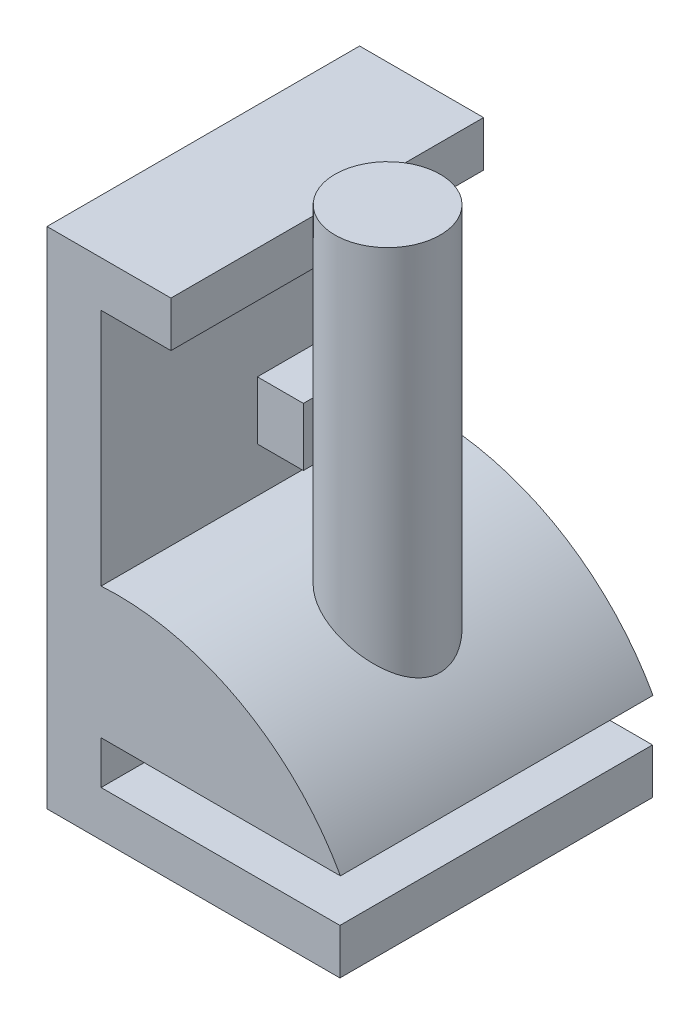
ISO-10303-21;
HEADER;
FILE_DESCRIPTION(('STEP AP214'),'2;1');
FILE_NAME('part.step','',(''),(''),'','','');
FILE_SCHEMA(('AUTOMOTIVE_DESIGN { 1 0 10303 214 1 1 1 1 }'));
ENDSEC;
DATA;
#1=APPLICATION_CONTEXT('core data for automotive mechanical design processes');
#2=APPLICATION_PROTOCOL_DEFINITION('international standard','automotive_design',2000,#1);
#3=PRODUCT_CONTEXT('',#1,'mechanical');
#4=PRODUCT('Part','Part','',(#3));
#5=PRODUCT_RELATED_PRODUCT_CATEGORY('part','',(#4));
#6=PRODUCT_DEFINITION_FORMATION('','',#4);
#7=PRODUCT_DEFINITION_CONTEXT('part definition',#1,'design');
#8=PRODUCT_DEFINITION('design','',#6,#7);
#9=PRODUCT_DEFINITION_SHAPE('','',#8);
#10=(LENGTH_UNIT() NAMED_UNIT(*) SI_UNIT(.MILLI.,.METRE.));
#11=(NAMED_UNIT(*) PLANE_ANGLE_UNIT() SI_UNIT($,.RADIAN.));
#12=(NAMED_UNIT(*) SI_UNIT($,.STERADIAN.) SOLID_ANGLE_UNIT());
#13=UNCERTAINTY_MEASURE_WITH_UNIT(LENGTH_MEASURE(1.E-05),#10,'distance_accuracy_value','');
#14=(GEOMETRIC_REPRESENTATION_CONTEXT(3) GLOBAL_UNCERTAINTY_ASSIGNED_CONTEXT((#13)) GLOBAL_UNIT_ASSIGNED_CONTEXT((#10,
#11,#12)) REPRESENTATION_CONTEXT('',''));
#15=CARTESIAN_POINT('',(0.,0.,0.));
#16=DIRECTION('',(0.,0.,1.));
#17=DIRECTION('',(1.,0.,0.));
#18=AXIS2_PLACEMENT_3D('',#15,#16,#17);
#19=CARTESIAN_POINT('',(152.004557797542,-86.5512105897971,47.5));
#20=DIRECTION('',(0.,1.,0.));
#21=DIRECTION('',(0.,0.,1.));
#22=AXIS2_PLACEMENT_3D('',#19,#20,#21);
#23=PLANE('',#22);
#24=DIRECTION('',(1.,0.,0.));
#25=VECTOR('',#24,1.);
#26=CARTESIAN_POINT('',(152.004557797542,-86.5512105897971,-47.5));
#27=LINE('',#26,#25);
#28=CARTESIAN_POINT('',(62.9855483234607,-86.5512105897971,-47.5));
#29=VERTEX_POINT('',#28);
#30=CARTESIAN_POINT('',(152.004557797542,-86.5512105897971,-47.5));
#31=VERTEX_POINT('',#30);
#32=EDGE_CURVE('E163',#29,#31,#27,.T.);
#33=ORIENTED_EDGE('',*,*,#32,.T.);
#34=DIRECTION('',(0.,0.,-1.));
#35=VECTOR('',#34,1.);
#36=CARTESIAN_POINT('',(152.004557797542,-86.5512105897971,47.5));
#37=LINE('',#36,#35);
#38=CARTESIAN_POINT('',(152.004557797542,-86.5512105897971,47.5));
#39=VERTEX_POINT('',#38);
#40=EDGE_CURVE('E11',#39,#31,#37,.T.);
#41=ORIENTED_EDGE('',*,*,#40,.F.);
#42=DIRECTION('',(1.,0.,0.));
#43=VECTOR('',#42,1.);
#44=CARTESIAN_POINT('',(152.004557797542,-86.5512105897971,47.5));
#45=LINE('',#44,#43);
#46=CARTESIAN_POINT('',(62.9855483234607,-86.5512105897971,47.5));
#47=VERTEX_POINT('',#46);
#48=EDGE_CURVE('E196',#47,#39,#45,.T.);
#49=ORIENTED_EDGE('',*,*,#48,.F.);
#50=DIRECTION('',(0.,0.,-1.));
#51=VECTOR('',#50,1.);
#52=CARTESIAN_POINT('',(62.9855483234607,-86.5512105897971,47.5));
#53=LINE('',#52,#51);
#54=EDGE_CURVE('E159',#47,#29,#53,.T.);
#55=ORIENTED_EDGE('',*,*,#54,.T.);
#56=EDGE_LOOP('',(#33,#41,#49,#55));
#57=FACE_BOUND('',#56,.T.);
#58=ADVANCED_FACE('F33',(#57),#23,.F.);
#59=CARTESIAN_POINT('',(152.004557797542,-86.5512105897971,47.5));
#60=DIRECTION('',(-1.,0.,0.));
#61=DIRECTION('',(0.,0.,1.));
#62=AXIS2_PLACEMENT_3D('',#59,#60,#61);
#63=PLANE('',#62);
#64=DIRECTION('',(0.,1.,0.));
#65=VECTOR('',#64,1.);
#66=CARTESIAN_POINT('',(152.004557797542,-86.5512105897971,-47.5));
#67=LINE('',#66,#65);
#68=CARTESIAN_POINT('',(152.004557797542,-72.710314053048,-47.5));
#69=VERTEX_POINT('',#68);
#70=EDGE_CURVE('E166',#31,#69,#67,.T.);
#71=ORIENTED_EDGE('',*,*,#70,.T.);
#72=DIRECTION('',(0.,0.,-1.));
#73=VECTOR('',#72,1.);
#74=CARTESIAN_POINT('',(152.004557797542,-72.710314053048,47.5));
#75=LINE('',#74,#73);
#76=CARTESIAN_POINT('',(152.004557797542,-72.710314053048,47.5));
#77=VERTEX_POINT('',#76);
#78=EDGE_CURVE('E41',#77,#69,#75,.T.);
#79=ORIENTED_EDGE('',*,*,#78,.F.);
#80=DIRECTION('',(0.,1.,0.));
#81=VECTOR('',#80,1.);
#82=CARTESIAN_POINT('',(152.004557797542,-86.5512105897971,47.5));
#83=LINE('',#82,#81);
#84=EDGE_CURVE('E114',#39,#77,#83,.T.);
#85=ORIENTED_EDGE('',*,*,#84,.F.);
#86=ORIENTED_EDGE('',*,*,#40,.T.);
#87=EDGE_LOOP('',(#71,#79,#85,#86));
#88=FACE_BOUND('',#87,.T.);
#89=ADVANCED_FACE('F276',(#88),#63,.F.);
#90=CARTESIAN_POINT('',(152.004557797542,-72.710314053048,47.5));
#91=DIRECTION('',(0.,-1.,0.));
#92=DIRECTION('',(1.,0.,0.));
#93=AXIS2_PLACEMENT_3D('',#90,#91,#92);
#94=PLANE('',#93);
#95=DIRECTION('',(-1.,0.,0.));
#96=VECTOR('',#95,1.);
#97=CARTESIAN_POINT('',(152.004557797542,-72.710314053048,-47.5));
#98=LINE('',#97,#96);
#99=CARTESIAN_POINT('',(79.4274220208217,-72.7103140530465,-47.5));
#100=VERTEX_POINT('',#99);
#101=EDGE_CURVE('E169',#69,#100,#98,.T.);
#102=ORIENTED_EDGE('',*,*,#101,.T.);
#103=DIRECTION('',(0.,0.,-1.));
#104=VECTOR('',#103,1.);
#105=CARTESIAN_POINT('',(79.4274220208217,-72.7103140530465,47.5));
#106=LINE('',#105,#104);
#107=CARTESIAN_POINT('',(79.4274220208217,-72.7103140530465,47.5));
#108=VERTEX_POINT('',#107);
#109=EDGE_CURVE('E220',#108,#100,#106,.T.);
#110=ORIENTED_EDGE('',*,*,#109,.F.);
#111=DIRECTION('',(-1.,0.,0.));
#112=VECTOR('',#111,1.);
#113=CARTESIAN_POINT('',(152.004557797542,-72.710314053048,47.5));
#114=LINE('',#113,#112);
#115=EDGE_CURVE('E228',#77,#108,#114,.T.);
#116=ORIENTED_EDGE('',*,*,#115,.F.);
#117=ORIENTED_EDGE('',*,*,#78,.T.);
#118=EDGE_LOOP('',(#102,#110,#116,#117));
#119=FACE_BOUND('',#118,.T.);
#120=ADVANCED_FACE('F226',(#119),#94,.F.);
#121=CARTESIAN_POINT('',(79.4274220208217,-72.7103140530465,47.5));
#122=DIRECTION('',(-1.,0.,0.));
#123=DIRECTION('',(0.,0.,1.));
#124=AXIS2_PLACEMENT_3D('',#121,#122,#123);
#125=PLANE('',#124);
#126=DIRECTION('',(0.,1.,0.));
#127=VECTOR('',#126,1.);
#128=CARTESIAN_POINT('',(79.4274220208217,-72.7103140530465,-47.5));
#129=LINE('',#128,#127);
#130=CARTESIAN_POINT('',(79.4274220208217,-59.6076484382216,-47.5));
#131=VERTEX_POINT('',#130);
#132=EDGE_CURVE('E171',#100,#131,#129,.T.);
#133=ORIENTED_EDGE('',*,*,#132,.T.);
#134=DIRECTION('',(0.,0.,-1.));
#135=VECTOR('',#134,1.);
#136=CARTESIAN_POINT('',(79.4274220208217,-59.6076484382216,47.5));
#137=LINE('',#136,#135);
#138=CARTESIAN_POINT('',(79.4274220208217,-59.6076484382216,47.5));
#139=VERTEX_POINT('',#138);
#140=EDGE_CURVE('E217',#139,#131,#137,.T.);
#141=ORIENTED_EDGE('',*,*,#140,.F.);
#142=DIRECTION('',(0.,1.,0.));
#143=VECTOR('',#142,1.);
#144=CARTESIAN_POINT('',(79.4274220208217,-72.7103140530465,47.5));
#145=LINE('',#144,#143);
#146=EDGE_CURVE('E246',#108,#139,#145,.T.);
#147=ORIENTED_EDGE('',*,*,#146,.F.);
#148=ORIENTED_EDGE('',*,*,#109,.T.);
#149=EDGE_LOOP('',(#133,#141,#147,#148));
#150=FACE_BOUND('',#149,.T.);
#151=ADVANCED_FACE('F237',(#150),#125,.F.);
#152=CARTESIAN_POINT('',(79.4274220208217,-59.6076484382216,47.5));
#153=DIRECTION('',(0.,1.,0.));
#154=DIRECTION('',(0.,0.,1.));
#155=AXIS2_PLACEMENT_3D('',#152,#153,#154);
#156=PLANE('',#155);
#157=DIRECTION('',(1.,0.,0.));
#158=VECTOR('',#157,1.);
#159=CARTESIAN_POINT('',(79.4274220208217,-59.6076484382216,-47.5));
#160=LINE('',#159,#158);
#161=CARTESIAN_POINT('',(152.150409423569,-59.6076484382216,-47.5));
#162=VERTEX_POINT('',#161);
#163=EDGE_CURVE('E173',#131,#162,#160,.T.);
#164=ORIENTED_EDGE('',*,*,#163,.T.);
#165=DIRECTION('',(0.,0.,-1.));
#166=VECTOR('',#165,1.);
#167=CARTESIAN_POINT('',(152.150409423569,-59.6076484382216,47.5));
#168=LINE('',#167,#166);
#169=CARTESIAN_POINT('',(152.150409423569,-59.6076484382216,47.5));
#170=VERTEX_POINT('',#169);
#171=EDGE_CURVE('E214',#170,#162,#168,.T.);
#172=ORIENTED_EDGE('',*,*,#171,.F.);
#173=DIRECTION('',(1.,0.,0.));
#174=VECTOR('',#173,1.);
#175=CARTESIAN_POINT('',(79.4274220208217,-59.6076484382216,47.5));
#176=LINE('',#175,#174);
#177=EDGE_CURVE('E243',#139,#170,#176,.T.);
#178=ORIENTED_EDGE('',*,*,#177,.F.);
#179=ORIENTED_EDGE('',*,*,#140,.T.);
#180=EDGE_LOOP('',(#164,#172,#178,#179));
#181=FACE_BOUND('',#180,.T.);
#182=ADVANCED_FACE('F241',(#181),#156,.F.);
#183=CARTESIAN_POINT('',(84.332901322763,-96.9649889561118,47.5));
#184=DIRECTION('',(0.,0.,-1.));
#185=DIRECTION('',(-1.,0.,0.));
#186=AXIS2_PLACEMENT_3D('',#183,#184,#185);
#187=CYLINDRICAL_SURFACE('',#186,77.4259988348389);
#188=CARTESIAN_POINT('',(102.999396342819,-21.8228086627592,0.));
#189=CARTESIAN_POINT('',(102.999395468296,-21.8228087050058,0.437460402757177));
#190=CARTESIAN_POINT('',(103.017351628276,-21.8272622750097,0.874906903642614));
#191=CARTESIAN_POINT('',(103.089022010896,-21.8451207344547,1.74666427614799));
#192=CARTESIAN_POINT('',(103.142734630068,-21.8585252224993,2.18097528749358));
#193=CARTESIAN_POINT('',(103.285452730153,-21.8944122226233,3.04329500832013));
#194=CARTESIAN_POINT('',(103.374451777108,-21.9168930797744,3.47130485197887));
#195=CARTESIAN_POINT('',(103.586991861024,-21.9711404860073,4.31806400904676));
#196=CARTESIAN_POINT('',(103.710533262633,-22.0029071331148,4.73681322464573));
#197=CARTESIAN_POINT('',(103.991094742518,-22.0759929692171,5.56204246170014));
#198=CARTESIAN_POINT('',(104.14811196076,-22.1173113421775,5.96852352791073));
#199=CARTESIAN_POINT('',(104.494284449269,-22.2098152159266,6.76639361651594));
#200=CARTESIAN_POINT('',(104.683439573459,-22.2610006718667,7.15778270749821));
#201=CARTESIAN_POINT('',(105.092252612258,-22.3735715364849,7.92275032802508));
#202=CARTESIAN_POINT('',(105.311910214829,-22.434956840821,8.2963290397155));
#203=CARTESIAN_POINT('',(105.779821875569,-22.5682548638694,9.02314205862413));
#204=CARTESIAN_POINT('',(106.028076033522,-22.6401676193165,9.37637629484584));
#205=CARTESIAN_POINT('',(106.552089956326,-22.795130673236,10.0615752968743));
#206=CARTESIAN_POINT('',(106.827958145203,-22.8782253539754,10.3934470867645));
#207=CARTESIAN_POINT('',(107.403928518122,-23.0555594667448,11.0322337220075));
#208=CARTESIAN_POINT('',(107.704030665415,-23.1497988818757,11.3391486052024));
#209=CARTESIAN_POINT('',(108.325863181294,-23.3495714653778,11.9262089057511));
#210=CARTESIAN_POINT('',(108.647593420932,-23.455104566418,12.2063544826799));
#211=CARTESIAN_POINT('',(109.309940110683,-23.6775080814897,12.7383822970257));
#212=CARTESIAN_POINT('',(109.65055686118,-23.7943786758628,12.9902640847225));
#213=CARTESIAN_POINT('',(110.355846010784,-24.0421906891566,13.4700354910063));
#214=CARTESIAN_POINT('',(110.720890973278,-24.173393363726,13.6972422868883));
#215=CARTESIAN_POINT('',(111.46471628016,-24.4473567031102,14.1199633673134));
#216=CARTESIAN_POINT('',(111.843496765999,-24.5901174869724,14.315477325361));
#217=CARTESIAN_POINT('',(112.611819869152,-24.8868531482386,14.6743056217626));
#218=CARTESIAN_POINT('',(113.001364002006,-25.0408296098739,14.837615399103));
#219=CARTESIAN_POINT('',(113.788232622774,-25.3594797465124,15.1318039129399));
#220=CARTESIAN_POINT('',(114.185557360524,-25.5241537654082,15.262681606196));
#221=CARTESIAN_POINT('',(115.008444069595,-25.8734454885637,15.4987663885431));
#222=CARTESIAN_POINT('',(115.434305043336,-26.058666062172,15.602039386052));
#223=CARTESIAN_POINT('',(116.288521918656,-26.4395160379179,15.7727890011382));
#224=CARTESIAN_POINT('',(116.716877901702,-26.6351457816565,15.8402644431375));
#225=CARTESIAN_POINT('',(117.573338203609,-27.035866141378,15.940089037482));
#226=CARTESIAN_POINT('',(118.001442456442,-27.2409586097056,15.9724312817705));
#227=CARTESIAN_POINT('',(118.85479177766,-27.6595036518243,16.0028057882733));
#228=CARTESIAN_POINT('',(119.28003653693,-27.872957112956,16.0008343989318));
#229=CARTESIAN_POINT('',(120.166580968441,-28.3282309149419,15.9616956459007));
#230=CARTESIAN_POINT('',(120.627353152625,-28.5707877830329,15.9211151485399));
#231=CARTESIAN_POINT('',(121.539975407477,-29.0629434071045,15.8010624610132));
#232=CARTESIAN_POINT('',(121.991824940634,-29.3125425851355,15.7215879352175));
#233=CARTESIAN_POINT('',(122.884490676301,-29.8172168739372,15.5249870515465));
#234=CARTESIAN_POINT('',(123.325300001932,-30.0722952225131,15.4078378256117));
#235=CARTESIAN_POINT('',(124.193479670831,-30.5859707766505,15.1371248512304));
#236=CARTESIAN_POINT('',(124.620849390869,-30.8445681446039,14.9835594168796));
#237=CARTESIAN_POINT('',(125.504232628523,-31.3905744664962,14.623141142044));
#238=CARTESIAN_POINT('',(125.95855038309,-31.6781610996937,14.4123890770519));
#239=CARTESIAN_POINT('',(126.845939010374,-32.2524992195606,13.9490017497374));
#240=CARTESIAN_POINT('',(127.279007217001,-32.53925059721,13.6963612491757));
#241=CARTESIAN_POINT('',(128.121391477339,-33.1088071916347,13.1501990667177));
#242=CARTESIAN_POINT('',(128.530705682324,-33.3916120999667,12.8566742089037));
#243=CARTESIAN_POINT('',(129.322857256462,-33.9497225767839,12.2295695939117));
#244=CARTESIAN_POINT('',(129.705699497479,-34.2250295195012,11.8959972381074));
#245=CARTESIAN_POINT('',(130.383527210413,-34.7213338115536,11.2455371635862));
#246=CARTESIAN_POINT('',(130.682812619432,-34.9440155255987,10.9344049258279));
#247=CARTESIAN_POINT('',(131.258593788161,-35.3785074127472,10.2845923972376));
#248=CARTESIAN_POINT('',(131.535090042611,-35.5903178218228,9.94591270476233));
#249=CARTESIAN_POINT('',(132.062652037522,-35.9996909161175,9.24193307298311));
#250=CARTESIAN_POINT('',(132.313747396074,-36.1972701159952,8.87666501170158));
#251=CARTESIAN_POINT('',(132.788189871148,-36.5749052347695,8.11996994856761));
#252=CARTESIAN_POINT('',(133.011543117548,-36.7549650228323,7.72854875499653));
#253=CARTESIAN_POINT('',(133.384797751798,-37.0588770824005,7.00380648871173));
#254=CARTESIAN_POINT('',(133.540365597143,-37.1866802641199,6.67505116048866));
#255=CARTESIAN_POINT('',(133.830441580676,-37.4266464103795,6.00289477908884));
#256=CARTESIAN_POINT('',(133.964954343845,-37.5388128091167,5.65949696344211));
#257=CARTESIAN_POINT('',(134.211193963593,-37.7453380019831,4.95961225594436));
#258=CARTESIAN_POINT('',(134.322933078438,-37.8397063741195,4.60313252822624));
#259=CARTESIAN_POINT('',(134.522072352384,-38.0086535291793,3.87881238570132));
#260=CARTESIAN_POINT('',(134.609472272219,-38.0832321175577,3.51097185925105));
#261=CARTESIAN_POINT('',(134.75898355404,-38.2112204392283,2.76371878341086));
#262=CARTESIAN_POINT('',(134.820909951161,-38.2644752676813,2.38424237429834));
#263=CARTESIAN_POINT('',(134.91738624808,-38.3475916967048,1.61926567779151));
#264=CARTESIAN_POINT('',(134.951936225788,-38.3774533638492,1.23376540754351));
#265=CARTESIAN_POINT('',(134.992943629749,-38.4129082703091,0.460285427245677));
#266=CARTESIAN_POINT('',(134.999410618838,-38.4185097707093,0.0723066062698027));
#267=CARTESIAN_POINT('',(134.98413786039,-38.4052959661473,-0.702656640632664));
#268=CARTESIAN_POINT('',(134.962400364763,-38.3864826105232,-1.08964114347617));
#269=CARTESIAN_POINT('',(134.895149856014,-38.3284303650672,-1.81629745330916));
#270=CARTESIAN_POINT('',(134.852548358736,-38.2916944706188,-2.1564467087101));
#271=CARTESIAN_POINT('',(134.746112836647,-38.2002178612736,-2.83091047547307));
#272=CARTESIAN_POINT('',(134.682280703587,-38.1454787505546,-3.16522550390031));
#273=CARTESIAN_POINT('',(134.534301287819,-38.0191309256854,-3.82609083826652));
#274=CARTESIAN_POINT('',(134.450151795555,-37.9475203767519,-4.15264029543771));
#275=CARTESIAN_POINT('',(134.262640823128,-37.7887987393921,-4.79630560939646));
#276=CARTESIAN_POINT('',(134.159278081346,-37.7016866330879,-5.11342084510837));
#277=CARTESIAN_POINT('',(133.928414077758,-37.5083303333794,-5.75384752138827));
#278=CARTESIAN_POINT('',(133.79990666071,-37.4013039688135,-6.07655997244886));
#279=CARTESIAN_POINT('',(133.524252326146,-37.1734482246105,-6.708934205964));
#280=CARTESIAN_POINT('',(133.377098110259,-37.0526134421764,-7.01859081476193));
#281=CARTESIAN_POINT('',(132.909593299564,-36.6719442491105,-7.9268318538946));
#282=CARTESIAN_POINT('',(132.563179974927,-36.3939275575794,-8.50474360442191));
#283=CARTESIAN_POINT('',(131.910570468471,-35.880824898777,-9.45572920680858));
#284=CARTESIAN_POINT('',(131.617811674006,-35.6537171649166,-9.8426644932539));
#285=CARTESIAN_POINT('',(131.003337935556,-35.1846933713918,-10.5834951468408));
#286=CARTESIAN_POINT('',(130.681612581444,-34.94277199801,-10.9373785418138));
#287=CARTESIAN_POINT('',(130.011791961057,-34.4478078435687,-11.6116894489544));
#288=CARTESIAN_POINT('',(129.663664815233,-34.1947517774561,-11.932075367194));
#289=CARTESIAN_POINT('',(128.943859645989,-33.6811589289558,-12.5384148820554));
#290=CARTESIAN_POINT('',(128.572183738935,-33.4206228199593,-12.8243715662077));
#291=CARTESIAN_POINT('',(127.803356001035,-32.8921805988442,-13.3641769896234));
#292=CARTESIAN_POINT('',(127.405974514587,-32.6242254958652,-13.6176502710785));
#293=CARTESIAN_POINT('',(126.591453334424,-32.086346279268,-14.0881260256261));
#294=CARTESIAN_POINT('',(126.174313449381,-31.8164221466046,-14.3051281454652));
#295=CARTESIAN_POINT('',(125.322391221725,-31.277082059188,-14.7016871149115));
#296=CARTESIAN_POINT('',(124.887611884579,-31.0076660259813,-14.8812503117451));
#297=CARTESIAN_POINT('',(124.002436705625,-30.4715227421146,-15.2018521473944));
#298=CARTESIAN_POINT('',(123.552040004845,-30.2047956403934,-15.3428886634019));
#299=CARTESIAN_POINT('',(122.5925587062,-29.649904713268,-15.5971395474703));
#300=CARTESIAN_POINT('',(122.082081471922,-29.3622360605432,-15.7062115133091));
#301=CARTESIAN_POINT('',(121.048317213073,-28.7952662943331,-15.8743388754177));
#302=CARTESIAN_POINT('',(120.525029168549,-28.5159658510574,-15.9333902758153));
#303=CARTESIAN_POINT('',(119.46951933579,-27.968200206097,-15.9995054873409));
#304=CARTESIAN_POINT('',(118.937297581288,-27.6997349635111,-16.0065694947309));
#305=CARTESIAN_POINT('',(117.868403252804,-27.1759533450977,-15.9668290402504));
#306=CARTESIAN_POINT('',(117.331731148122,-26.9206356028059,-15.9200301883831));
#307=CARTESIAN_POINT('',(116.293394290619,-26.4411062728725,-15.7757526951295));
#308=CARTESIAN_POINT('',(115.791688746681,-26.2159497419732,-15.6817117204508));
#309=CARTESIAN_POINT('',(114.793526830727,-25.780496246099,-15.4441096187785));
#310=CARTESIAN_POINT('',(114.297070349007,-25.5701989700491,-15.3005495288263));
#311=CARTESIAN_POINT('',(113.314951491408,-25.1659088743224,-14.963616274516));
#312=CARTESIAN_POINT('',(112.829281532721,-24.9719043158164,-14.7702793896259));
#313=CARTESIAN_POINT('',(111.873937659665,-24.6010539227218,-14.3339942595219));
#314=CARTESIAN_POINT('',(111.404261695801,-24.4242058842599,-14.0910523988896));
#315=CARTESIAN_POINT('',(110.539427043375,-24.1076594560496,-13.5873379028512));
#316=CARTESIAN_POINT('',(110.141907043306,-23.9660273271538,-13.331821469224));
#317=CARTESIAN_POINT('',(109.367946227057,-23.6969902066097,-12.7840177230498));
#318=CARTESIAN_POINT('',(108.99150374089,-23.5695840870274,-12.4917333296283));
#319=CARTESIAN_POINT('',(108.263808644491,-23.3291021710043,-11.8723043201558));
#320=CARTESIAN_POINT('',(107.912546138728,-23.2160207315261,-11.545173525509));
#321=CARTESIAN_POINT('',(107.238853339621,-23.0040033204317,-10.8582622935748));
#322=CARTESIAN_POINT('',(106.916421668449,-22.9050666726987,-10.4984834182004));
#323=CARTESIAN_POINT('',(106.327933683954,-22.7282678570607,-9.77844441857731));
#324=CARTESIAN_POINT('',(106.059439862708,-22.6493620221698,-9.42042880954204));
#325=CARTESIAN_POINT('',(105.552468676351,-22.5030195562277,-8.68154993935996));
#326=CARTESIAN_POINT('',(105.313989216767,-22.4355821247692,-8.30068827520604));
#327=CARTESIAN_POINT('',(104.869266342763,-22.3118154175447,-7.5188594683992));
#328=CARTESIAN_POINT('',(104.663023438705,-22.2554863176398,-7.11789200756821));
#329=CARTESIAN_POINT('',(104.284693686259,-22.1535614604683,-6.29882768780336));
#330=CARTESIAN_POINT('',(104.112607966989,-22.1079660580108,-5.88073026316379));
#331=CARTESIAN_POINT('',(103.800605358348,-22.0262110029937,-5.02067924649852));
#332=CARTESIAN_POINT('',(103.661529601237,-21.9902954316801,-4.5783969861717));
#333=CARTESIAN_POINT('',(103.42215561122,-21.9289912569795,-3.68273663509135));
#334=CARTESIAN_POINT('',(103.321858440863,-21.9036029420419,-3.22935824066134));
#335=CARTESIAN_POINT('',(103.161005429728,-21.8630936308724,-2.31517579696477));
#336=CARTESIAN_POINT('',(103.100447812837,-21.8479721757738,-1.85437208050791));
#337=CARTESIAN_POINT('',(103.019644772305,-21.827829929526,-0.92904022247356));
#338=CARTESIAN_POINT('',(102.99939727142,-21.8228086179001,-0.464512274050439));
#339=CARTESIAN_POINT('',(102.999396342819,-21.8228086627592,0.));
#340=B_SPLINE_CURVE_WITH_KNOTS('',3,(#188,#189,#190,#191,#192,#193,#194,#195,#196,#197,#198,
#199,#200,#201,#202,#203,#204,#205,#206,#207,#208,#209,#210,#211,#212,#213,#214,#215,#216,#217,
#218,#219,#220,#221,#222,#223,#224,#225,#226,#227,#228,#229,#230,#231,#232,#233,#234,#235,#236,
#237,#238,#239,#240,#241,#242,#243,#244,#245,#246,#247,#248,#249,#250,#251,#252,#253,#254,#255,
#256,#257,#258,#259,#260,#261,#262,#263,#264,#265,#266,#267,#268,#269,#270,#271,#272,#273,#274,
#275,#276,#277,#278,#279,#280,#281,#282,#283,#284,#285,#286,#287,#288,#289,#290,#291,#292,#293,
#294,#295,#296,#297,#298,#299,#300,#301,#302,#303,#304,#305,#306,#307,#308,#309,#310,#311,#312,
#313,#314,#315,#316,#317,#318,#319,#320,#321,#322,#323,#324,#325,#326,#327,#328,#329,#330,#331,
#332,#333,#334,#335,#336,#337,#338,#339),.UNSPECIFIED.,.T.,.F.,(4,2,2,2,2,2,2,2,2,2,2,2,2,2,2,2,
2,2,2,2,2,2,2,2,2,2,2,2,2,2,2,2,2,2,2,2,2,2,2,2,2,2,2,2,2,2,2,2,2,2,2,2,2,2,2,2,2,2,2,2,2,2,2,2,
2,2,2,2,2,2,2,2,2,2,2,4),(0.,1.31196687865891,2.6238749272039,3.93554387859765,5.24722667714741,
6.55879745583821,7.87036227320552,9.18191367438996,10.4934696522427,11.8103939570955,
13.1273162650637,14.4442307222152,15.7611661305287,17.1083080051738,18.4554637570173,
19.8028101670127,21.1501999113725,22.5759006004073,24.0016481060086,25.427675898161,
26.8538554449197,28.4190984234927,29.9844354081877,31.5507243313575,33.1170857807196,
34.8476999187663,36.578530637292,38.3094958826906,40.0401417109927,41.496093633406,
42.952013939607,44.4062165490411,45.8600972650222,47.0155523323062,48.1707532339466,
49.3253306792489,50.4799194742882,51.6427498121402,52.8055768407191,53.9680078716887,
55.1303460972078,56.1634776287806,57.1965171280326,58.2296690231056,59.2628887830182,
60.3522281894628,61.4419952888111,63.6213443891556,65.2267053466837,66.8326455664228,
68.4405567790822,70.0483236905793,71.6732585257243,73.2982090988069,74.9228839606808,
76.5476483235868,78.3334307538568,80.1193558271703,81.9052741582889,83.6910064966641,
85.3623740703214,87.0337066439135,88.7038245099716,90.3737275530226,91.8517559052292,
93.3296669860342,94.8069940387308,96.2842504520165,97.6458099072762,99.0072742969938,
100.368760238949,101.730291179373,103.123483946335,104.516714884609,105.909883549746,
107.302980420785),.UNSPECIFIED.);
#341=CARTESIAN_POINT('',(102.999396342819,-21.8228086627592,0.));
#342=VERTEX_POINT('',#341);
#343=EDGE_CURVE('E407',#342,#342,#340,.T.);
#344=ORIENTED_EDGE('',*,*,#343,.F.);
#345=EDGE_LOOP('',(#344));
#346=FACE_BOUND('',#345,.T.);
#347=CARTESIAN_POINT('',(84.332901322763,-96.9649889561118,-47.5));
#348=DIRECTION('',(0.,0.,1.));
#349=DIRECTION('',(-1.,0.,0.));
#350=AXIS2_PLACEMENT_3D('',#347,#348,#349);
#351=CIRCLE('',#350,77.4259988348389);
#352=CARTESIAN_POINT('',(79.4274220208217,-19.6945446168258,-47.5));
#353=VERTEX_POINT('',#352);
#354=EDGE_CURVE('E175',#162,#353,#351,.T.);
#355=ORIENTED_EDGE('',*,*,#354,.T.);
#356=DIRECTION('',(0.,0.,-1.));
#357=VECTOR('',#356,1.);
#358=CARTESIAN_POINT('',(79.4274220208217,-19.6945446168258,47.5));
#359=LINE('',#358,#357);
#360=CARTESIAN_POINT('',(79.4274220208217,-19.6945446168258,47.5));
#361=VERTEX_POINT('',#360);
#362=EDGE_CURVE('E211',#361,#353,#359,.T.);
#363=ORIENTED_EDGE('',*,*,#362,.F.);
#364=CARTESIAN_POINT('',(84.332901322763,-96.9649889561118,47.5));
#365=DIRECTION('',(0.,0.,1.));
#366=DIRECTION('',(-1.,0.,0.));
#367=AXIS2_PLACEMENT_3D('',#364,#365,#366);
#368=CIRCLE('',#367,77.4259988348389);
#369=EDGE_CURVE('E245',#170,#361,#368,.T.);
#370=ORIENTED_EDGE('',*,*,#369,.F.);
#371=ORIENTED_EDGE('',*,*,#171,.T.);
#372=EDGE_LOOP('',(#355,#363,#370,#371));
#373=FACE_BOUND('',#372,.T.);
#374=ADVANCED_FACE('F289',(#346,#373),#187,.T.);
#375=CARTESIAN_POINT('',(79.4274220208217,-6.05335723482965,47.5));
#376=DIRECTION('',(0.,1.,0.));
#377=DIRECTION('',(0.,0.,1.));
#378=AXIS2_PLACEMENT_3D('',#375,#376,#377);
#379=PLANE('',#378);
#380=DIRECTION('',(0.,0.,-1.));
#381=VECTOR('',#380,1.);
#382=CARTESIAN_POINT('',(93.3999473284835,-6.05335723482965,47.5));
#383=LINE('',#382,#381);
#384=CARTESIAN_POINT('',(93.3999473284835,-6.05335723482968,0.));
#385=VERTEX_POINT('',#384);
#386=CARTESIAN_POINT('',(93.3999473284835,-6.05335723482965,-47.5));
#387=VERTEX_POINT('',#386);
#388=EDGE_CURVE('E207',#385,#387,#383,.T.);
#389=ORIENTED_EDGE('',*,*,#388,.F.);
#390=DIRECTION('',(1.,0.,0.));
#391=VECTOR('',#390,1.);
#392=CARTESIAN_POINT('',(79.4274220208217,-6.05335723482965,0.));
#393=LINE('',#392,#391);
#394=CARTESIAN_POINT('',(79.4274220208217,-6.05335723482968,0.));
#395=VERTEX_POINT('',#394);
#396=EDGE_CURVE('E413',#395,#385,#393,.T.);
#397=ORIENTED_EDGE('',*,*,#396,.F.);
#398=DIRECTION('',(0.,0.,-1.));
#399=VECTOR('',#398,1.);
#400=CARTESIAN_POINT('',(79.4274220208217,-6.05335723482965,47.5));
#401=LINE('',#400,#399);
#402=CARTESIAN_POINT('',(79.4274220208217,-6.05335723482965,-47.5));
#403=VERTEX_POINT('',#402);
#404=EDGE_CURVE('E209',#395,#403,#401,.T.);
#405=ORIENTED_EDGE('',*,*,#404,.T.);
#406=DIRECTION('',(1.,0.,0.));
#407=VECTOR('',#406,1.);
#408=CARTESIAN_POINT('',(79.4274220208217,-6.05335723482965,-47.5));
#409=LINE('',#408,#407);
#410=EDGE_CURVE('E180',#403,#387,#409,.T.);
#411=ORIENTED_EDGE('',*,*,#410,.T.);
#412=EDGE_LOOP('',(#389,#397,#405,#411));
#413=FACE_BOUND('',#412,.T.);
#414=ADVANCED_FACE('F292',(#413),#379,.F.);
#415=CARTESIAN_POINT('',(93.3999473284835,-6.05335723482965,47.5));
#416=DIRECTION('',(-1.,0.,0.));
#417=DIRECTION('',(0.,0.,1.));
#418=AXIS2_PLACEMENT_3D('',#415,#416,#417);
#419=PLANE('',#418);
#420=DIRECTION('',(0.,0.,-1.));
#421=VECTOR('',#420,1.);
#422=CARTESIAN_POINT('',(93.3999473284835,11.6296634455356,47.5));
#423=LINE('',#422,#421);
#424=CARTESIAN_POINT('',(93.3999473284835,11.6296634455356,0.));
#425=VERTEX_POINT('',#424);
#426=CARTESIAN_POINT('',(93.3999473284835,11.6296634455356,-47.5));
#427=VERTEX_POINT('',#426);
#428=EDGE_CURVE('E205',#425,#427,#423,.T.);
#429=ORIENTED_EDGE('',*,*,#428,.F.);
#430=DIRECTION('',(0.,1.,0.));
#431=VECTOR('',#430,1.);
#432=CARTESIAN_POINT('',(93.3999473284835,-86.5522105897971,0.));
#433=LINE('',#432,#431);
#434=EDGE_CURVE('E419',#385,#425,#433,.T.);
#435=ORIENTED_EDGE('',*,*,#434,.F.);
#436=ORIENTED_EDGE('',*,*,#388,.T.);
#437=DIRECTION('',(0.,1.,0.));
#438=VECTOR('',#437,1.);
#439=CARTESIAN_POINT('',(93.3999473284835,-6.05335723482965,-47.5));
#440=LINE('',#439,#438);
#441=EDGE_CURVE('E183',#387,#427,#440,.T.);
#442=ORIENTED_EDGE('',*,*,#441,.T.);
#443=EDGE_LOOP('',(#429,#435,#436,#442));
#444=FACE_BOUND('',#443,.T.);
#445=ADVANCED_FACE('F296',(#444),#419,.F.);
#446=CARTESIAN_POINT('',(93.3999473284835,11.6296634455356,47.5));
#447=DIRECTION('',(0.,-1.,0.));
#448=DIRECTION('',(0.,0.,-1.));
#449=AXIS2_PLACEMENT_3D('',#446,#447,#448);
#450=PLANE('',#449);
#451=DIRECTION('',(0.,0.,-1.));
#452=VECTOR('',#451,1.);
#453=CARTESIAN_POINT('',(79.4274220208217,11.6296634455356,47.5));
#454=LINE('',#453,#452);
#455=CARTESIAN_POINT('',(79.4274220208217,11.6296634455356,0.));
#456=VERTEX_POINT('',#455);
#457=CARTESIAN_POINT('',(79.4274220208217,11.6296634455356,-47.5));
#458=VERTEX_POINT('',#457);
#459=EDGE_CURVE('E203',#456,#458,#454,.T.);
#460=ORIENTED_EDGE('',*,*,#459,.F.);
#461=DIRECTION('',(-1.,0.,0.));
#462=VECTOR('',#461,1.);
#463=CARTESIAN_POINT('',(79.4274220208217,11.6296634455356,0.));
#464=LINE('',#463,#462);
#465=EDGE_CURVE('E415',#425,#456,#464,.T.);
#466=ORIENTED_EDGE('',*,*,#465,.F.);
#467=ORIENTED_EDGE('',*,*,#428,.T.);
#468=DIRECTION('',(-1.,0.,0.));
#469=VECTOR('',#468,1.);
#470=CARTESIAN_POINT('',(93.3999473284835,11.6296634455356,-47.5));
#471=LINE('',#470,#469);
#472=EDGE_CURVE('E186',#427,#458,#471,.T.);
#473=ORIENTED_EDGE('',*,*,#472,.T.);
#474=EDGE_LOOP('',(#460,#466,#467,#473));
#475=FACE_BOUND('',#474,.T.);
#476=ADVANCED_FACE('F300',(#475),#450,.F.);
#477=CARTESIAN_POINT('',(79.4274220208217,11.6296634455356,47.5));
#478=DIRECTION('',(-1.,0.,0.));
#479=DIRECTION('',(0.,0.,1.));
#480=AXIS2_PLACEMENT_3D('',#477,#478,#479);
#481=PLANE('',#480);
#482=DIRECTION('',(0.,1.,0.));
#483=VECTOR('',#482,1.);
#484=CARTESIAN_POINT('',(79.4274220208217,11.6296634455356,-47.5));
#485=LINE('',#484,#483);
#486=CARTESIAN_POINT('',(79.4274220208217,52.8867530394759,-47.5));
#487=VERTEX_POINT('',#486);
#488=EDGE_CURVE('E189',#458,#487,#485,.T.);
#489=ORIENTED_EDGE('',*,*,#488,.T.);
#490=DIRECTION('',(0.,0.,-1.));
#491=VECTOR('',#490,1.);
#492=CARTESIAN_POINT('',(79.4274220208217,52.8867530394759,47.5));
#493=LINE('',#492,#491);
#494=CARTESIAN_POINT('',(79.4274220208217,52.8867530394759,47.5));
#495=VERTEX_POINT('',#494);
#496=EDGE_CURVE('E200',#495,#487,#493,.T.);
#497=ORIENTED_EDGE('',*,*,#496,.F.);
#498=DIRECTION('',(0.,1.,0.));
#499=VECTOR('',#498,1.);
#500=CARTESIAN_POINT('',(79.4274220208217,-19.6945446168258,47.5));
#501=LINE('',#500,#499);
#502=EDGE_CURVE('E248',#361,#495,#501,.T.);
#503=ORIENTED_EDGE('',*,*,#502,.F.);
#504=ORIENTED_EDGE('',*,*,#362,.T.);
#505=DIRECTION('',(0.,1.,0.));
#506=VECTOR('',#505,1.);
#507=CARTESIAN_POINT('',(79.4274220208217,-19.6945446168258,-47.5));
#508=LINE('',#507,#506);
#509=EDGE_CURVE('E177',#353,#403,#508,.T.);
#510=ORIENTED_EDGE('',*,*,#509,.T.);
#511=ORIENTED_EDGE('',*,*,#404,.F.);
#512=DIRECTION('',(0.,1.,0.));
#513=VECTOR('',#512,1.);
#514=CARTESIAN_POINT('',(79.4274220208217,-86.5522105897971,0.));
#515=LINE('',#514,#513);
#516=EDGE_CURVE('E167',#395,#456,#515,.T.);
#517=ORIENTED_EDGE('',*,*,#516,.T.);
#518=ORIENTED_EDGE('',*,*,#459,.T.);
#519=EDGE_LOOP('',(#489,#497,#503,#504,#510,#511,#517,#518));
#520=FACE_BOUND('',#519,.T.);
#521=ADVANCED_FACE('F257',(#520),#481,.F.);
#522=CARTESIAN_POINT('',(79.4274220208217,52.8867530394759,47.5));
#523=DIRECTION('',(0.,1.,0.));
#524=DIRECTION('',(0.,0.,1.));
#525=AXIS2_PLACEMENT_3D('',#522,#523,#524);
#526=PLANE('',#525);
#527=DIRECTION('',(1.,0.,0.));
#528=VECTOR('',#527,1.);
#529=CARTESIAN_POINT('',(79.4274220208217,52.8867530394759,-47.5));
#530=LINE('',#529,#528);
#531=CARTESIAN_POINT('',(100.6545595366,52.8867530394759,-47.5));
#532=VERTEX_POINT('',#531);
#533=EDGE_CURVE('E191',#487,#532,#530,.T.);
#534=ORIENTED_EDGE('',*,*,#533,.T.);
#535=DIRECTION('',(0.,0.,-1.));
#536=VECTOR('',#535,1.);
#537=CARTESIAN_POINT('',(100.6545595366,52.8867530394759,47.5));
#538=LINE('',#537,#536);
#539=CARTESIAN_POINT('',(100.6545595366,52.8867530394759,47.5));
#540=VERTEX_POINT('',#539);
#541=EDGE_CURVE('E154',#540,#532,#538,.T.);
#542=ORIENTED_EDGE('',*,*,#541,.F.);
#543=DIRECTION('',(1.,0.,0.));
#544=VECTOR('',#543,1.);
#545=CARTESIAN_POINT('',(79.4274220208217,52.8867530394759,47.5));
#546=LINE('',#545,#544);
#547=EDGE_CURVE('E145',#495,#540,#546,.T.);
#548=ORIENTED_EDGE('',*,*,#547,.F.);
#549=ORIENTED_EDGE('',*,*,#496,.T.);
#550=EDGE_LOOP('',(#534,#542,#548,#549));
#551=FACE_BOUND('',#550,.T.);
#552=ADVANCED_FACE('F261',(#551),#526,.F.);
#553=CARTESIAN_POINT('',(100.6545595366,52.8867530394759,47.5));
#554=DIRECTION('',(-1.,0.,0.));
#555=DIRECTION('',(0.,0.,1.));
#556=AXIS2_PLACEMENT_3D('',#553,#554,#555);
#557=PLANE('',#556);
#558=DIRECTION('',(0.,1.,0.));
#559=VECTOR('',#558,1.);
#560=CARTESIAN_POINT('',(100.6545595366,52.8867530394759,-47.5));
#561=LINE('',#560,#559);
#562=CARTESIAN_POINT('',(100.6545595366,66.7276495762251,-47.5));
#563=VERTEX_POINT('',#562);
#564=EDGE_CURVE('E153',#532,#563,#561,.T.);
#565=ORIENTED_EDGE('',*,*,#564,.T.);
#566=DIRECTION('',(0.,0.,-1.));
#567=VECTOR('',#566,1.);
#568=CARTESIAN_POINT('',(100.6545595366,66.7276495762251,47.5));
#569=LINE('',#568,#567);
#570=CARTESIAN_POINT('',(100.6545595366,66.7276495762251,47.5));
#571=VERTEX_POINT('',#570);
#572=EDGE_CURVE('E150',#571,#563,#569,.T.);
#573=ORIENTED_EDGE('',*,*,#572,.F.);
#574=DIRECTION('',(0.,1.,0.));
#575=VECTOR('',#574,1.);
#576=CARTESIAN_POINT('',(100.6545595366,52.8867530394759,47.5));
#577=LINE('',#576,#575);
#578=EDGE_CURVE('E139',#540,#571,#577,.T.);
#579=ORIENTED_EDGE('',*,*,#578,.F.);
#580=ORIENTED_EDGE('',*,*,#541,.T.);
#581=EDGE_LOOP('',(#565,#573,#579,#580));
#582=FACE_BOUND('',#581,.T.);
#583=ADVANCED_FACE('F151',(#582),#557,.F.);
#584=CARTESIAN_POINT('',(62.9855483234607,66.7276495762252,47.5));
#585=DIRECTION('',(0.,-1.,0.));
#586=DIRECTION('',(1.,0.,0.));
#587=AXIS2_PLACEMENT_3D('',#584,#585,#586);
#588=PLANE('',#587);
#589=DIRECTION('',(-1.,0.,0.));
#590=VECTOR('',#589,1.);
#591=CARTESIAN_POINT('',(62.9855483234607,66.7276495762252,-47.5));
#592=LINE('',#591,#590);
#593=CARTESIAN_POINT('',(62.9855483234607,66.7276495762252,-47.5));
#594=VERTEX_POINT('',#593);
#595=EDGE_CURVE('E100',#563,#594,#592,.T.);
#596=ORIENTED_EDGE('',*,*,#595,.T.);
#597=DIRECTION('',(0.,0.,-1.));
#598=VECTOR('',#597,1.);
#599=CARTESIAN_POINT('',(62.9855483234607,66.7276495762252,47.5));
#600=LINE('',#599,#598);
#601=CARTESIAN_POINT('',(62.9855483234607,66.7276495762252,47.5));
#602=VERTEX_POINT('',#601);
#603=EDGE_CURVE('E155',#602,#594,#600,.T.);
#604=ORIENTED_EDGE('',*,*,#603,.F.);
#605=DIRECTION('',(-1.,0.,0.));
#606=VECTOR('',#605,1.);
#607=CARTESIAN_POINT('',(62.9855483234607,66.7276495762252,47.5));
#608=LINE('',#607,#606);
#609=EDGE_CURVE('E143',#571,#602,#608,.T.);
#610=ORIENTED_EDGE('',*,*,#609,.F.);
#611=ORIENTED_EDGE('',*,*,#572,.T.);
#612=EDGE_LOOP('',(#596,#604,#610,#611));
#613=FACE_BOUND('',#612,.T.);
#614=ADVANCED_FACE('F157',(#613),#588,.F.);
#615=CARTESIAN_POINT('',(62.9855483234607,-86.5512105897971,47.5));
#616=DIRECTION('',(1.,0.,0.));
#617=DIRECTION('',(0.,1.,0.));
#618=AXIS2_PLACEMENT_3D('',#615,#616,#617);
#619=PLANE('',#618);
#620=DIRECTION('',(0.,-1.,0.));
#621=VECTOR('',#620,1.);
#622=CARTESIAN_POINT('',(62.9855483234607,-86.5512105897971,-47.5));
#623=LINE('',#622,#621);
#624=EDGE_CURVE('E106',#594,#29,#623,.T.);
#625=ORIENTED_EDGE('',*,*,#624,.T.);
#626=ORIENTED_EDGE('',*,*,#54,.F.);
#627=DIRECTION('',(0.,-1.,0.));
#628=VECTOR('',#627,1.);
#629=CARTESIAN_POINT('',(62.9855483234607,-86.5512105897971,47.5));
#630=LINE('',#629,#628);
#631=EDGE_CURVE('E49',#602,#47,#630,.T.);
#632=ORIENTED_EDGE('',*,*,#631,.F.);
#633=ORIENTED_EDGE('',*,*,#603,.T.);
#634=EDGE_LOOP('',(#625,#626,#632,#633));
#635=FACE_BOUND('',#634,.T.);
#636=ADVANCED_FACE('F265',(#635),#619,.F.);
#637=CARTESIAN_POINT('',(84.332901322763,-96.9649889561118,47.5));
#638=DIRECTION('',(0.,0.,-1.));
#639=DIRECTION('',(-1.,0.,0.));
#640=AXIS2_PLACEMENT_3D('',#637,#638,#639);
#641=PLANE('',#640);
#642=ORIENTED_EDGE('',*,*,#502,.T.);
#643=ORIENTED_EDGE('',*,*,#547,.T.);
#644=ORIENTED_EDGE('',*,*,#578,.T.);
#645=ORIENTED_EDGE('',*,*,#609,.T.);
#646=ORIENTED_EDGE('',*,*,#631,.T.);
#647=ORIENTED_EDGE('',*,*,#48,.T.);
#648=ORIENTED_EDGE('',*,*,#84,.T.);
#649=ORIENTED_EDGE('',*,*,#115,.T.);
#650=ORIENTED_EDGE('',*,*,#146,.T.);
#651=ORIENTED_EDGE('',*,*,#177,.T.);
#652=ORIENTED_EDGE('',*,*,#369,.T.);
#653=EDGE_LOOP('',(#642,#643,#644,#645,#646,#647,#648,#649,#650,#651,#652));
#654=FACE_BOUND('',#653,.T.);
#655=ADVANCED_FACE('F141',(#654),#641,.F.);
#656=CARTESIAN_POINT('',(84.332901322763,-96.9649889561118,-47.5));
#657=DIRECTION('',(0.,0.,-1.));
#658=DIRECTION('',(-1.,0.,0.));
#659=AXIS2_PLACEMENT_3D('',#656,#657,#658);
#660=PLANE('',#659);
#661=ORIENTED_EDGE('',*,*,#32,.F.);
#662=ORIENTED_EDGE('',*,*,#624,.F.);
#663=ORIENTED_EDGE('',*,*,#595,.F.);
#664=ORIENTED_EDGE('',*,*,#564,.F.);
#665=ORIENTED_EDGE('',*,*,#533,.F.);
#666=ORIENTED_EDGE('',*,*,#488,.F.);
#667=ORIENTED_EDGE('',*,*,#472,.F.);
#668=ORIENTED_EDGE('',*,*,#441,.F.);
#669=ORIENTED_EDGE('',*,*,#410,.F.);
#670=ORIENTED_EDGE('',*,*,#509,.F.);
#671=ORIENTED_EDGE('',*,*,#354,.F.);
#672=ORIENTED_EDGE('',*,*,#163,.F.);
#673=ORIENTED_EDGE('',*,*,#132,.F.);
#674=ORIENTED_EDGE('',*,*,#101,.F.);
#675=ORIENTED_EDGE('',*,*,#70,.F.);
#676=EDGE_LOOP('',(#661,#662,#663,#664,#665,#666,#667,#668,#669,#670,#671,#672,#673,#674,#675));
#677=FACE_BOUND('',#676,.T.);
#678=ADVANCED_FACE('F232',(#677),#660,.T.);
#679=CARTESIAN_POINT('',(79.4274220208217,-86.5522105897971,0.));
#680=DIRECTION('',(0.,0.,-1.));
#681=DIRECTION('',(-1.,0.,0.));
#682=AXIS2_PLACEMENT_3D('',#679,#680,#681);
#683=PLANE('',#682);
#684=ORIENTED_EDGE('',*,*,#396,.T.);
#685=ORIENTED_EDGE('',*,*,#434,.T.);
#686=ORIENTED_EDGE('',*,*,#465,.T.);
#687=ORIENTED_EDGE('',*,*,#516,.F.);
#688=EDGE_LOOP('',(#684,#685,#686,#687));
#689=FACE_BOUND('',#688,.T.);
#690=ADVANCED_FACE('F332',(#689),#683,.F.);
#691=CARTESIAN_POINT('',(118.997137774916,76.7276495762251,0.));
#692=DIRECTION('',(0.,1.,0.));
#693=DIRECTION('',(-1.,0.,0.));
#694=AXIS2_PLACEMENT_3D('',#691,#692,#693);
#695=PLANE('',#694);
#696=CARTESIAN_POINT('',(118.997137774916,76.7276495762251,0.));
#697=DIRECTION('',(0.,1.,0.));
#698=DIRECTION('',(-1.,0.,0.));
#699=AXIS2_PLACEMENT_3D('',#696,#697,#698);
#700=CIRCLE('',#699,15.9977414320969);
#701=CARTESIAN_POINT('',(102.999396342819,76.7276495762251,0.));
#702=VERTEX_POINT('',#701);
#703=EDGE_CURVE('E414',#702,#702,#700,.T.);
#704=ORIENTED_EDGE('',*,*,#703,.T.);
#705=EDGE_LOOP('',(#704));
#706=FACE_BOUND('',#705,.T.);
#707=ADVANCED_FACE('F372',(#706),#695,.T.);
#708=CARTESIAN_POINT('',(118.997137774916,-86.5522105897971,0.));
#709=DIRECTION('',(0.,1.,0.));
#710=DIRECTION('',(-1.,0.,0.));
#711=AXIS2_PLACEMENT_3D('',#708,#709,#710);
#712=CYLINDRICAL_SURFACE('',#711,15.9977414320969);
#713=ORIENTED_EDGE('',*,*,#703,.F.);
#714=EDGE_LOOP('',(#713));
#715=FACE_BOUND('',#714,.T.);
#716=ORIENTED_EDGE('',*,*,#343,.T.);
#717=EDGE_LOOP('',(#716));
#718=FACE_BOUND('',#717,.T.);
#719=ADVANCED_FACE('F388',(#715,#718),#712,.T.);
#720=CLOSED_SHELL('',(#58,#89,#120,#151,#182,#374,#414,#445,#476,#521,#552,#583,#614,#636,#655,
#678,#690,#707,#719));
#721=MANIFOLD_SOLID_BREP('B2',#720);
#722=ADVANCED_BREP_SHAPE_REPRESENTATION('',(#18,#721),#14);
#723=SHAPE_DEFINITION_REPRESENTATION(#9,#722);
ENDSEC;
END-ISO-10303-21;
